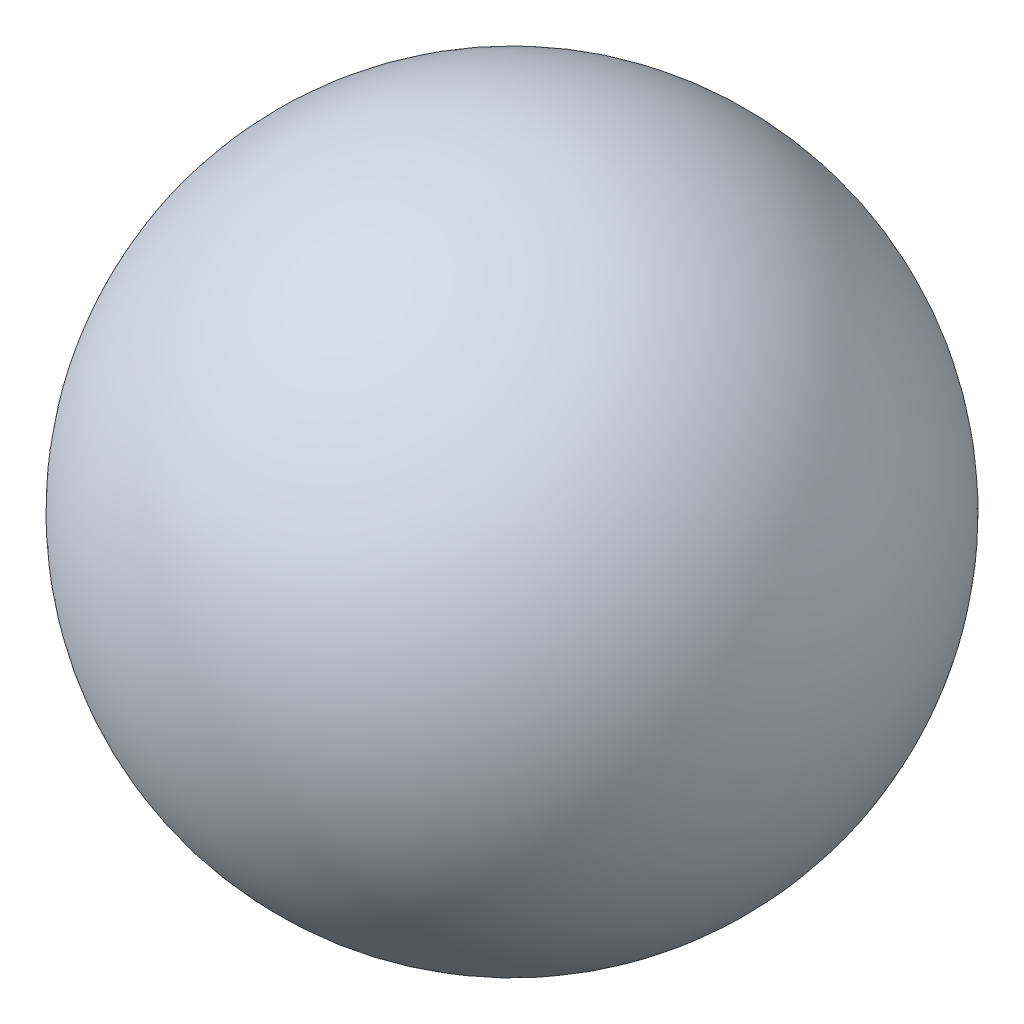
ISO-10303-21;
HEADER;
FILE_DESCRIPTION(('STEP AP214'),'2;1');
FILE_NAME('part.step','',(''),(''),'','','');
FILE_SCHEMA(('AUTOMOTIVE_DESIGN { 1 0 10303 214 1 1 1 1 }'));
ENDSEC;
DATA;
#1=APPLICATION_CONTEXT('core data for automotive mechanical design processes');
#2=APPLICATION_PROTOCOL_DEFINITION('international standard','automotive_design',2000,#1);
#3=PRODUCT_CONTEXT('',#1,'mechanical');
#4=PRODUCT('Part','Part','',(#3));
#5=PRODUCT_RELATED_PRODUCT_CATEGORY('part','',(#4));
#6=PRODUCT_DEFINITION_FORMATION('','',#4);
#7=PRODUCT_DEFINITION_CONTEXT('part definition',#1,'design');
#8=PRODUCT_DEFINITION('design','',#6,#7);
#9=PRODUCT_DEFINITION_SHAPE('','',#8);
#10=(LENGTH_UNIT() NAMED_UNIT(*) SI_UNIT(.MILLI.,.METRE.));
#11=(NAMED_UNIT(*) PLANE_ANGLE_UNIT() SI_UNIT($,.RADIAN.));
#12=(NAMED_UNIT(*) SI_UNIT($,.STERADIAN.) SOLID_ANGLE_UNIT());
#13=UNCERTAINTY_MEASURE_WITH_UNIT(LENGTH_MEASURE(1.E-05),#10,'distance_accuracy_value','');
#14=(GEOMETRIC_REPRESENTATION_CONTEXT(3) GLOBAL_UNCERTAINTY_ASSIGNED_CONTEXT((#13)) GLOBAL_UNIT_ASSIGNED_CONTEXT((#10,
#11,#12)) REPRESENTATION_CONTEXT('',''));
#15=CARTESIAN_POINT('',(0.,0.,0.));
#16=DIRECTION('',(0.,0.,1.));
#17=DIRECTION('',(1.,0.,0.));
#18=AXIS2_PLACEMENT_3D('',#15,#16,#17);
#19=CARTESIAN_POINT('',(6.39999999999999,-8.32667268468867E-13,-6.90000000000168));
#20=DIRECTION('',(-1.,0.,0.));
#21=DIRECTION('',(0.,0.,-1.));
#22=AXIS2_PLACEMENT_3D('',#19,#20,#21);
#23=SPHERICAL_SURFACE('',#22,4.8);
#24=CARTESIAN_POINT('',(1.59999999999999,-8.32667268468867E-13,-6.90000000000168));
#25=VERTEX_POINT('',#24);
#26=VERTEX_LOOP('',#25);
#27=FACE_BOUND('',#26,.T.);
#28=ADVANCED_FACE('F25',(#27),#23,.T.);
#29=CLOSED_SHELL('',(#28));
#30=MANIFOLD_SOLID_BREP('B2',#29);
#31=ADVANCED_BREP_SHAPE_REPRESENTATION('',(#18,#30),#14);
#32=SHAPE_DEFINITION_REPRESENTATION(#9,#31);
ENDSEC;
END-ISO-10303-21;
